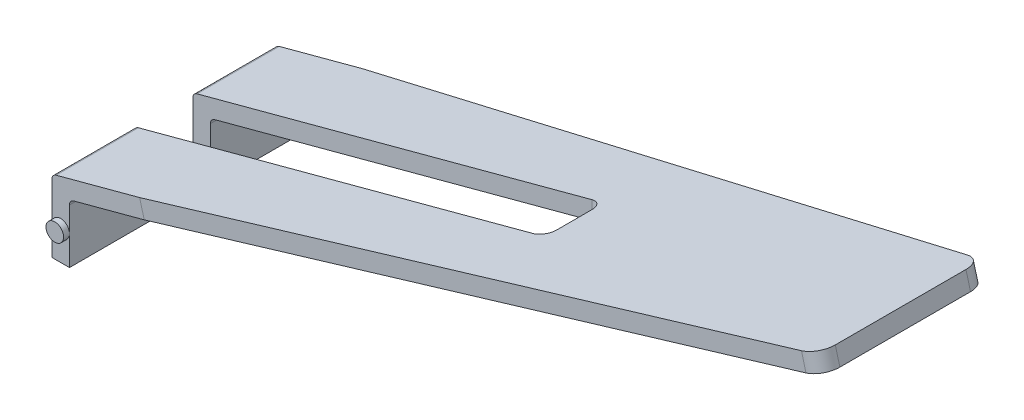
from build123d import *

# Parameters (mm, degrees)
BOSS_EXTRUDE1_DEPTH      = 3.8
CHAMFER1_SIZE            = 0.5
CHAMFER1_SIZE2           = 11.451882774
BOSS_EXTRUDE2_DEPTH      = 0.1
BOSS_EXTRUDE2_DEPTH_BACK = 3.9
SKETCH3_R                = 0.15
SKETCH4_W                = 7
SKETCH4_H                = 1
CUT_EXTRUDE2_DEPTH       = 10
FILLET1_R                = 0.1
FILLET2_R                = 0.3
FILLET3_R                = 0.2


with BuildPart() as part:
    # Sketch1 → Boss-Extrude1 (new body)
    with BuildSketch(Plane.XY):
        Polygon((0, 0), (0, 1.230198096), (12.557035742, 4.594845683), (12.634681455, 4.305067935), (0.3, 1), (0.3, 0), align=None)
    extrude(amount=BOSS_EXTRUDE1_DEPTH)

    # Chamfer1
    chamfer1_edges = [part.edges().sort_by_distance(p)[0] for p in [
        (12.595858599, 4.449956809, 3.8),
        (12.595858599, 4.449956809, 0),
    ]]
    chamfer1_side = [part.faces().sort_by_distance(p)[0] for p in [
        (12.595858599, 4.449956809, 1.9),
    ]]
    chamfer(chamfer1_edges, length=CHAMFER1_SIZE, length2=CHAMFER1_SIZE2, reference=chamfer1_side[0])

    # Sketch3 → Boss-Extrude2 (add, two sides: drawn at the far end of the back side and taken through both)
    with BuildSketch(Plane.XY.offset(3.8).offset(-BOSS_EXTRUDE2_DEPTH_BACK)):
        with Locations((0.15, 0.5)):
            Circle(SKETCH3_R)
    extrude(amount=BOSS_EXTRUDE2_DEPTH + BOSS_EXTRUDE2_DEPTH_BACK)

    # Sketch4 → Cut-Extrude2 (cut)
    with BuildSketch(Plane.XZ):
        with Locations((3.5, 1.9)):
            Rectangle(SKETCH4_W, SKETCH4_H)
    extrude(amount=-CUT_EXTRUDE2_DEPTH, mode=Mode.SUBTRACT)

    # Fillet1
    fillet1_edges = [part.edges().sort_by_distance(p)[0] for p in [
        (0, 1.230198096, 3.1),
        (0.3, 1, 3.1),
        (0, 1.230198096, 0.7),
        (0.3, 1, 0.7),
    ]]
    fillet(fillet1_edges, radius=FILLET1_R)

    # Fillet2
    fillet2_edges = [part.edges().sort_by_distance(p)[0] for p in [
        (12.595858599, 4.449956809, 0.5),
        (12.595858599, 4.449956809, 3.3),
    ]]
    fillet(fillet2_edges, radius=FILLET2_R)

    # Fillet3
    fillet3_edges = [part.edges().sort_by_distance(p)[0] for p in [
        (7, 2.950551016, 2.4),
        (7, 2.950551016, 1.4),
    ]]
    fillet(fillet3_edges, radius=FILLET3_R)


solid = part.part
